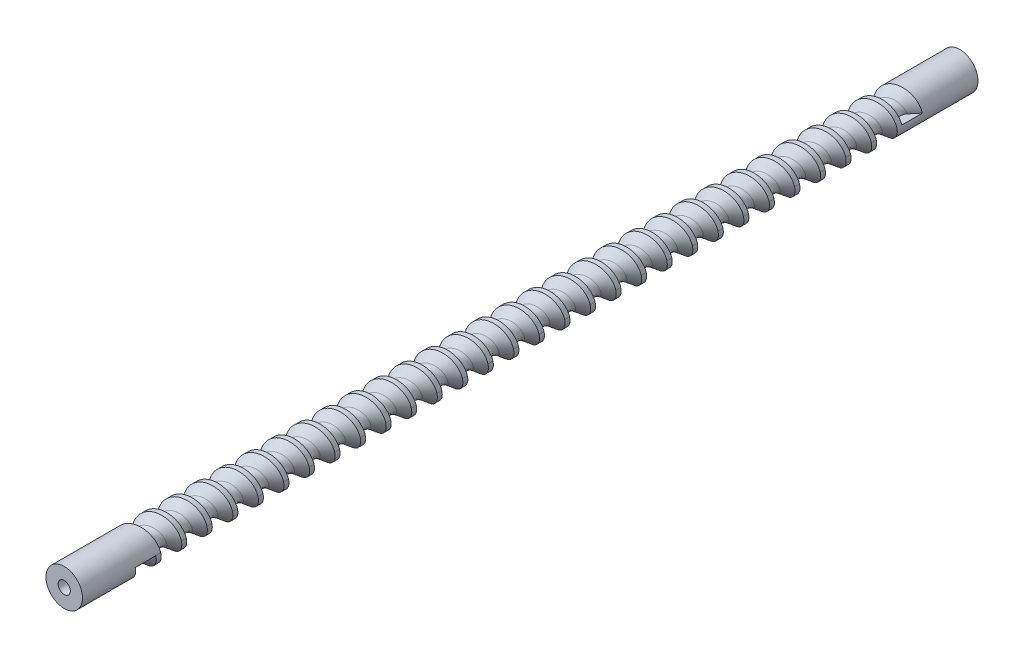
from build123d import *

# Parameters (mm, degrees)
SKETCH1_R              = 15
BOSS_EXTRUDE1_DEPTH    = 736
CUT_SWEEP1_PITCH       = 21.00000000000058
CUT_SWEEP1_HEIGHT      = 630.0000000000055
CUT_SWEEP1_RADIUS      = 15
CUT_SWEEP1_START_ANGLE = 180
SKETCH5_R              = 5
CUT_EXTRUDE1_DEPTH     = 10


with BuildPart() as part:
    # Sketch1 → Boss-Extrude1 (new body)
    with BuildSketch(Plane.XY):
        Circle(SKETCH1_R)
    extrude(amount=BOSS_EXTRUDE1_DEPTH)

    # Cut-Sweep1: sweep along a helix
    with BuildLine() as cut_sweep1_path:
        add(Helix(CUT_SWEEP1_PITCH, CUT_SWEEP1_HEIGHT, CUT_SWEEP1_RADIUS, center=(0, 0, 686), direction=(0, 0, -1), mode=Mode.PRIVATE).rotate(Axis((0, 0, 686), (0, 0, -1)), CUT_SWEEP1_START_ANGLE))
    # Sketch3 → Cut-Sweep1 (sweep, cut)
    with BuildSketch(Plane(origin=(0, 0, 0), x_dir=(0, 0, -1), z_dir=(1, 0, 0))):
        with BuildLine():
            Line((-689.1549791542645, -25.114635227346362), (-667.7874759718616, -17.220770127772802))
            Line((-667.7874759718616, -17.220770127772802), (-677.314473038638, -9.304534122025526))
            ThreePointArc((-677.314473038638, -9.304534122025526), (-683.2282681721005, -8.291110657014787), (-687.0628162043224, -12.90589574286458))
            Line((-687.0628162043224, -12.90589574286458), (-689.1549791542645, -25.114635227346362))
        make_face()
    sweep(path=cut_sweep1_path.line, is_frenet=True, mode=Mode.SUBTRACT)

    # Sketch5 → Cut-Extrude1 (cut)
    with BuildSketch(Plane.XY.offset(736)):
        Circle(SKETCH5_R)
    extrude(amount=-CUT_EXTRUDE1_DEPTH, mode=Mode.SUBTRACT)


solid = part.part
